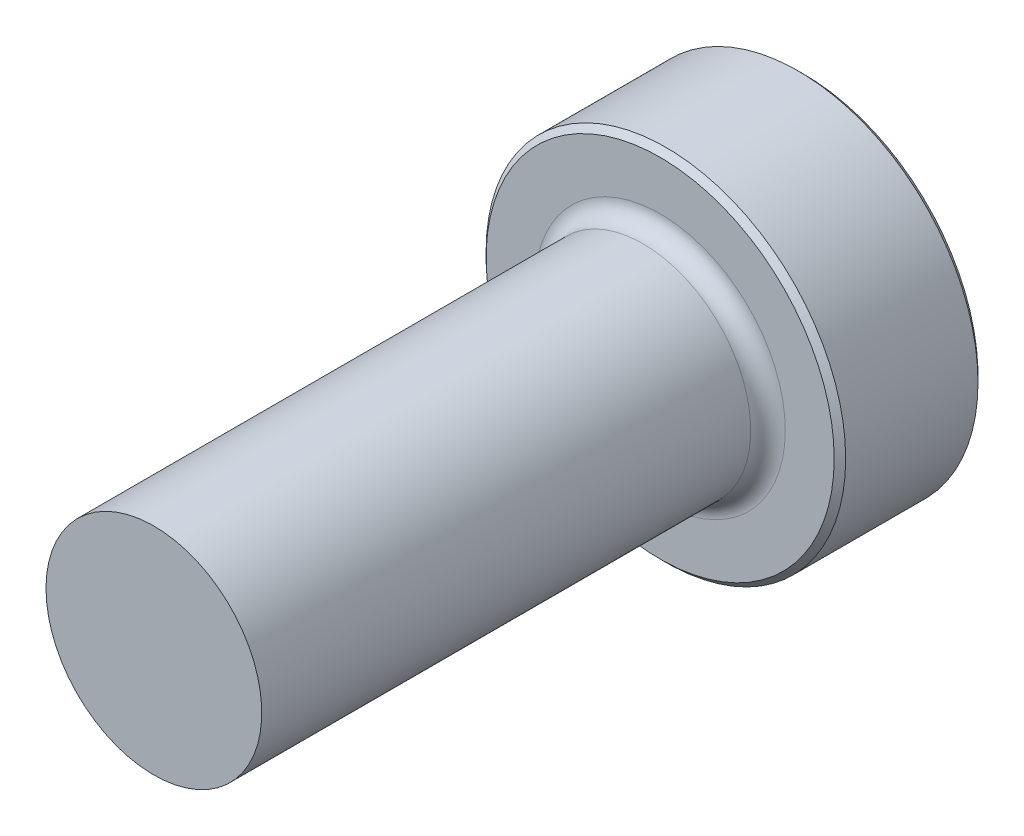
ISO-10303-21;
HEADER;
FILE_DESCRIPTION(('STEP AP214'),'2;1');
FILE_NAME('part.step','',(''),(''),'','','');
FILE_SCHEMA(('AUTOMOTIVE_DESIGN { 1 0 10303 214 1 1 1 1 }'));
ENDSEC;
DATA;
#1=APPLICATION_CONTEXT('core data for automotive mechanical design processes');
#2=APPLICATION_PROTOCOL_DEFINITION('international standard','automotive_design',2000,#1);
#3=PRODUCT_CONTEXT('',#1,'mechanical');
#4=PRODUCT('Part','Part','',(#3));
#5=PRODUCT_RELATED_PRODUCT_CATEGORY('part','',(#4));
#6=PRODUCT_DEFINITION_FORMATION('','',#4);
#7=PRODUCT_DEFINITION_CONTEXT('part definition',#1,'design');
#8=PRODUCT_DEFINITION('design','',#6,#7);
#9=PRODUCT_DEFINITION_SHAPE('','',#8);
#10=(LENGTH_UNIT() NAMED_UNIT(*) SI_UNIT(.MILLI.,.METRE.));
#11=(NAMED_UNIT(*) PLANE_ANGLE_UNIT() SI_UNIT($,.RADIAN.));
#12=(NAMED_UNIT(*) SI_UNIT($,.STERADIAN.) SOLID_ANGLE_UNIT());
#13=UNCERTAINTY_MEASURE_WITH_UNIT(LENGTH_MEASURE(1.E-05),#10,'distance_accuracy_value','');
#14=(GEOMETRIC_REPRESENTATION_CONTEXT(3) GLOBAL_UNCERTAINTY_ASSIGNED_CONTEXT((#13)) GLOBAL_UNIT_ASSIGNED_CONTEXT((#10,
#11,#12)) REPRESENTATION_CONTEXT('',''));
#15=CARTESIAN_POINT('',(0.,0.,0.));
#16=DIRECTION('',(0.,0.,1.));
#17=DIRECTION('',(1.,0.,0.));
#18=AXIS2_PLACEMENT_3D('',#15,#16,#17);
#19=CARTESIAN_POINT('',(0.,4.76249999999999,28.702));
#20=DIRECTION('',(0.,0.,1.));
#21=DIRECTION('',(1.,0.,0.));
#22=AXIS2_PLACEMENT_3D('',#19,#20,#21);
#23=PLANE('',#22);
#24=CARTESIAN_POINT('',(0.,0.,28.702));
#25=DIRECTION('',(0.,0.,-1.));
#26=DIRECTION('',(-1.,0.,0.));
#27=AXIS2_PLACEMENT_3D('',#24,#25,#26);
#28=CIRCLE('',#27,4.76249999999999);
#29=CARTESIAN_POINT('',(-4.76249999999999,0.,28.702));
#30=VERTEX_POINT('',#29);
#31=EDGE_CURVE('E50',#30,#30,#28,.T.);
#32=ORIENTED_EDGE('',*,*,#31,.F.);
#33=EDGE_LOOP('',(#32));
#34=FACE_BOUND('',#33,.T.);
#35=ADVANCED_FACE('F30',(#34),#23,.T.);
#36=CARTESIAN_POINT('',(0.,0.,-25.4347445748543));
#37=DIRECTION('',(0.,0.,-1.));
#38=DIRECTION('',(-1.,0.,0.));
#39=AXIS2_PLACEMENT_3D('',#36,#37,#38);
#40=CYLINDRICAL_SURFACE('',#39,4.76249999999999);
#41=ORIENTED_EDGE('',*,*,#31,.T.);
#42=EDGE_LOOP('',(#41));
#43=FACE_BOUND('',#42,.T.);
#44=CARTESIAN_POINT('',(0.,0.,7.112));
#45=DIRECTION('',(0.,0.,-1.));
#46=DIRECTION('',(-1.,0.,0.));
#47=AXIS2_PLACEMENT_3D('',#44,#45,#46);
#48=CIRCLE('',#47,4.7625);
#49=CARTESIAN_POINT('',(-4.7625,0.,7.112));
#50=VERTEX_POINT('',#49);
#51=EDGE_CURVE('E53',#50,#50,#48,.T.);
#52=ORIENTED_EDGE('',*,*,#51,.F.);
#53=EDGE_LOOP('',(#52));
#54=FACE_BOUND('',#53,.T.);
#55=ADVANCED_FACE('F64',(#43,#54),#40,.T.);
#56=CARTESIAN_POINT('',(0.,0.,7.112));
#57=DIRECTION('',(0.,0.,-1.));
#58=DIRECTION('',(-1.,0.,0.));
#59=AXIS2_PLACEMENT_3D('',#56,#57,#58);
#60=TOROIDAL_SURFACE('',#59,5.5245,0.761999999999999);
#61=ORIENTED_EDGE('',*,*,#51,.T.);
#62=EDGE_LOOP('',(#61));
#63=FACE_BOUND('',#62,.T.);
#64=CARTESIAN_POINT('',(0.,0.,6.35));
#65=DIRECTION('',(0.,0.,-1.));
#66=DIRECTION('',(-1.,0.,0.));
#67=AXIS2_PLACEMENT_3D('',#64,#65,#66);
#68=CIRCLE('',#67,5.5245);
#69=CARTESIAN_POINT('',(-5.5245,0.,6.35));
#70=VERTEX_POINT('',#69);
#71=EDGE_CURVE('E56',#70,#70,#68,.T.);
#72=ORIENTED_EDGE('',*,*,#71,.F.);
#73=EDGE_LOOP('',(#72));
#74=FACE_BOUND('',#73,.T.);
#75=ADVANCED_FACE('F62',(#63,#74),#60,.F.);
#76=CARTESIAN_POINT('',(0.,7.9375,6.35));
#77=DIRECTION('',(0.,0.,1.));
#78=DIRECTION('',(1.,0.,0.));
#79=AXIS2_PLACEMENT_3D('',#76,#77,#78);
#80=PLANE('',#79);
#81=CARTESIAN_POINT('',(0.,0.,6.35));
#82=DIRECTION('',(0.,0.,1.));
#83=DIRECTION('',(1.,0.,0.));
#84=AXIS2_PLACEMENT_3D('',#81,#82,#83);
#85=CIRCLE('',#84,7.6835);
#86=CARTESIAN_POINT('',(7.6835,0.,6.35));
#87=VERTEX_POINT('',#86);
#88=EDGE_CURVE('E10',#87,#87,#85,.T.);
#89=ORIENTED_EDGE('',*,*,#88,.T.);
#90=EDGE_LOOP('',(#89));
#91=FACE_BOUND('',#90,.T.);
#92=ORIENTED_EDGE('',*,*,#71,.T.);
#93=EDGE_LOOP('',(#92));
#94=FACE_BOUND('',#93,.T.);
#95=ADVANCED_FACE('F60',(#91,#94),#80,.T.);
#96=CARTESIAN_POINT('',(0.,0.,-25.4347445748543));
#97=DIRECTION('',(0.,0.,-1.));
#98=DIRECTION('',(-1.,0.,0.));
#99=AXIS2_PLACEMENT_3D('',#96,#97,#98);
#100=CYLINDRICAL_SURFACE('',#99,7.9375);
#101=CARTESIAN_POINT('',(0.,0.,0.253999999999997));
#102=DIRECTION('',(0.,0.,-1.));
#103=DIRECTION('',(-1.,0.,0.));
#104=AXIS2_PLACEMENT_3D('',#101,#102,#103);
#105=CIRCLE('',#104,7.9375);
#106=CARTESIAN_POINT('',(-7.9375,0.,0.253999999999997));
#107=VERTEX_POINT('',#106);
#108=EDGE_CURVE('E37',#107,#107,#105,.F.);
#109=ORIENTED_EDGE('',*,*,#108,.T.);
#110=EDGE_LOOP('',(#109));
#111=FACE_BOUND('',#110,.T.);
#112=CARTESIAN_POINT('',(0.,0.,6.096));
#113=DIRECTION('',(0.,0.,1.));
#114=DIRECTION('',(1.,0.,0.));
#115=AXIS2_PLACEMENT_3D('',#112,#113,#114);
#116=CIRCLE('',#115,7.9375);
#117=CARTESIAN_POINT('',(7.9375,0.,6.096));
#118=VERTEX_POINT('',#117);
#119=EDGE_CURVE('E41',#118,#118,#116,.F.);
#120=ORIENTED_EDGE('',*,*,#119,.T.);
#121=EDGE_LOOP('',(#120));
#122=FACE_BOUND('',#121,.T.);
#123=ADVANCED_FACE('F71',(#111,#122),#100,.T.);
#124=CARTESIAN_POINT('',(0.,0.,0.));
#125=DIRECTION('',(0.,0.,-1.));
#126=DIRECTION('',(-1.,0.,0.));
#127=AXIS2_PLACEMENT_3D('',#124,#125,#126);
#128=PLANE('',#127);
#129=CARTESIAN_POINT('',(0.,0.,0.));
#130=DIRECTION('',(0.,0.,-1.));
#131=DIRECTION('',(-1.,0.,0.));
#132=AXIS2_PLACEMENT_3D('',#129,#130,#131);
#133=CIRCLE('',#132,7.6835);
#134=CARTESIAN_POINT('',(-7.6835,0.,0.));
#135=VERTEX_POINT('',#134);
#136=EDGE_CURVE('E45',#135,#135,#133,.T.);
#137=ORIENTED_EDGE('',*,*,#136,.T.);
#138=EDGE_LOOP('',(#137));
#139=FACE_BOUND('',#138,.T.);
#140=ADVANCED_FACE('F83',(#139),#128,.T.);
#141=CARTESIAN_POINT('',(0.,0.,0.));
#142=DIRECTION('',(0.,0.,1.));
#143=DIRECTION('',(1.,0.,0.));
#144=AXIS2_PLACEMENT_3D('',#141,#142,#143);
#145=CONICAL_SURFACE('',#144,7.6835,0.785398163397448);
#146=ORIENTED_EDGE('',*,*,#108,.F.);
#147=EDGE_LOOP('',(#146));
#148=FACE_BOUND('',#147,.T.);
#149=ORIENTED_EDGE('',*,*,#136,.F.);
#150=EDGE_LOOP('',(#149));
#151=FACE_BOUND('',#150,.T.);
#152=ADVANCED_FACE('F81',(#148,#151),#145,.T.);
#153=CARTESIAN_POINT('',(0.,0.,6.096));
#154=DIRECTION('',(0.,0.,-1.));
#155=DIRECTION('',(-1.,0.,0.));
#156=AXIS2_PLACEMENT_3D('',#153,#154,#155);
#157=CONICAL_SURFACE('',#156,7.9375,0.785398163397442);
#158=ORIENTED_EDGE('',*,*,#88,.F.);
#159=EDGE_LOOP('',(#158));
#160=FACE_BOUND('',#159,.T.);
#161=ORIENTED_EDGE('',*,*,#119,.F.);
#162=EDGE_LOOP('',(#161));
#163=FACE_BOUND('',#162,.T.);
#164=ADVANCED_FACE('F32',(#160,#163),#157,.T.);
#165=CLOSED_SHELL('',(#35,#55,#75,#95,#123,#140,#152,#164));
#166=MANIFOLD_SOLID_BREP('B2',#165);
#167=ADVANCED_BREP_SHAPE_REPRESENTATION('',(#18,#166),#14);
#168=SHAPE_DEFINITION_REPRESENTATION(#9,#167);
ENDSEC;
END-ISO-10303-21;
